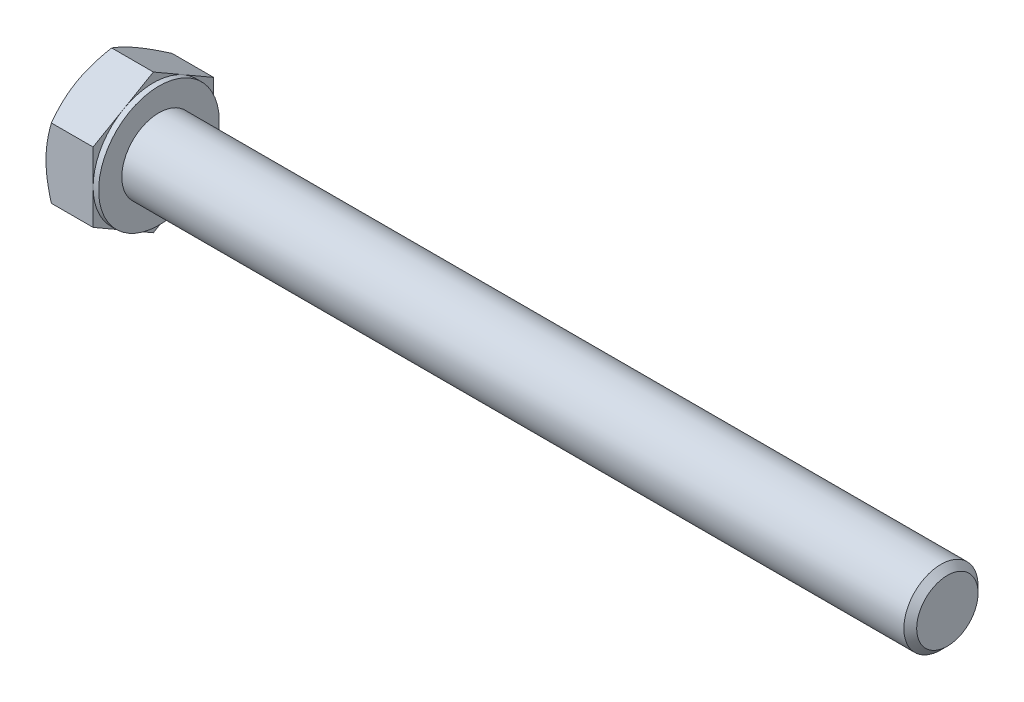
from build123d import *

# Parameters (mm, degrees)
BASEHEAD_DEPTH = 5.675
SKETCH4_W      = 0.6
SKETCH4_H      = 11.005553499


with BuildPart() as part:
    # Sketch1 → BaseHead (new body)
    with BuildSketch(Plane(origin=(0, 0, 0), x_dir=(0, 0, -1), z_dir=(1, 0, 0))):
        Polygon((6.5, 3.75277675), (6.5, -3.75277675), (0, -7.505553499), (-6.5, -3.75277675), (-6.5, 3.75277675), (0, 7.505553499), align=None)
    extrude(amount=BASEHEAD_DEPTH)

    # BodySke → BaseBody (revolve)
    with BuildSketch(Plane.XY, mode=Mode.PRIVATE) as basebody_sk:
        Polygon((0, 0), (90.675, 0), (90.675, 3.3095), (89.9845, 4), (0, 4), align=None)
    revolve(basebody_sk.sketch.rotate(Axis((0, 0, 0), (1, 0, 0)), 90), axis=Axis((0, 0, 0), (1, 0, 0)))

    # Sketch3 → HeadChamfer (revolve, cut)
    with BuildSketch(Plane.XY):
        Polygon((0, 6.5), (3.46730793, 12.505553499), (3.46730793, 17.505553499), (-10, 17.505553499), (-10, 6.5), align=None)
    revolve(axis=Axis((0, 0, 0), (1, 0, 0)), mode=Mode.SUBTRACT)

    # Sketch4 → BearingFace (revolve, cut)
    with BuildSketch(Plane.XY, mode=Mode.PRIVATE) as bearingface_sk:
        with Locations((5.375, 12.00277675)):
            Rectangle(SKETCH4_W, SKETCH4_H)
    revolve(bearingface_sk.sketch.rotate(Axis((0, 0, 0), (1, 0, 0)), 270), axis=Axis((0, 0, 0), (1, 0, 0)), mode=Mode.SUBTRACT)


solid = part.part
